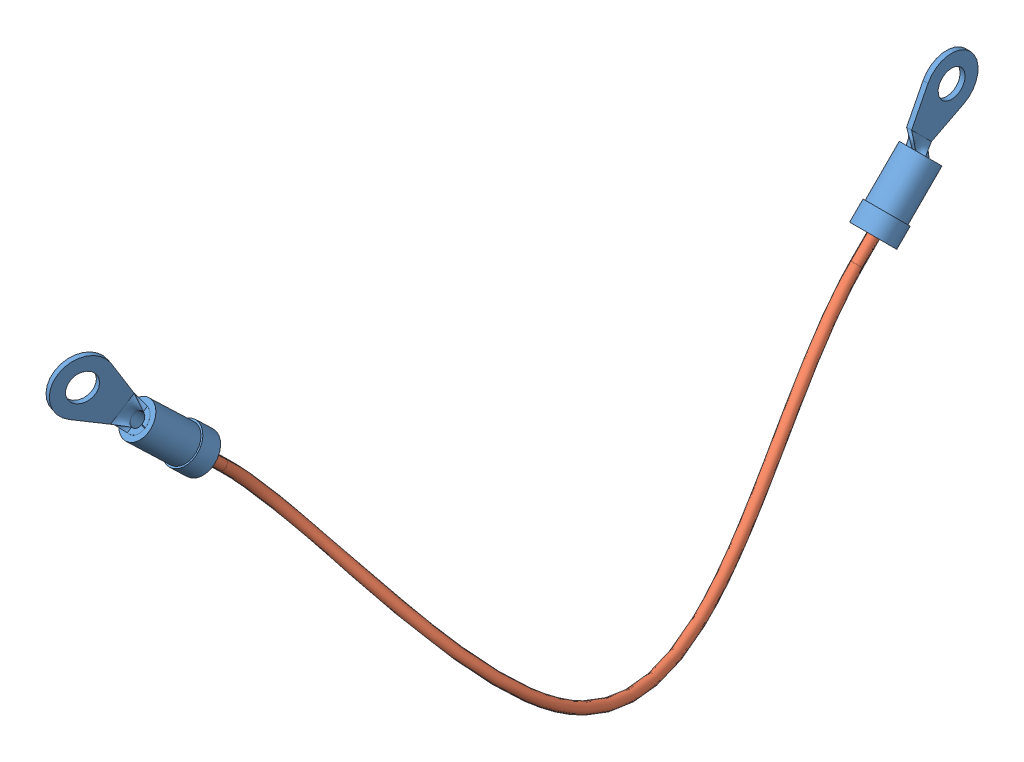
SolidWorks assembly Ring_0-6-002_10.sldasm, configuration Default (file format 13000). Lengths in mm.
Overall size (38.59 61.25 143.29).
3 component instances, 2 part files, 4 mates.
Components (placement in the parent):
- ring_term_awg-14_10-15: ring_term_awg-14_10.SLDPRT [Default] at (-4.7486 115.2525 270.1437) x (0.229644 -0.669131 -0.706773) z (-0.206773 -0.743145 0.636381) size (27.02 6.1 8.38)
- ring_term_awg-14_10-16: ring_term_awg-14_10.SLDPRT [Default] at (2.3813 95.25 139.7) x (0 -0.707107 0.707107) z (0 0.707107 0.707107) size (27.02 6.1 8.38)
- Cable-Ring_0-6-002_10-1: Cable-Ring_0-6-002_10.sldprt [Default] at origin size (30.63 47.17 113.8)
Mates (geometry in assembly coordinates):
- Concentric11: concentric: cylinder of assembly through (-6.7113 115.2525 269.5059) axis (0.951057 0 0.309017) radius 1.905; cylinder of ring_term_awg-14_10-15 through (-5.5035 115.2525 269.8984) axis (0.951057 0 0.309017) radius 2.1463; cylinder of ?
- Coincident11: coincident anti-aligned: plane of ring_term_awg-14_10-15 through (-5.5035 115.2525 269.8984) normal (-0.951057 0 -0.309017); plane of assembly through (-14.2513 115.2525 296.8214) normal (0.951057 0 0.309017)
- Concentric21: concentric: cylinder of assembly through (-1.5875 95.25 139.7) axis (1 0 0) radius 1.5875; cylinder of ring_term_awg-14_10-16 through (1.5875 95.25 139.7) axis (1 0 0) radius 2.1463; cylinder of ?
- Coincident21: coincident anti-aligned: plane of ring_term_awg-14_10-16 through (1.5875 95.25 139.7) normal (-1 0 0); plane of assembly through (1.5875 190.5 203.2) normal (1 0 0)
